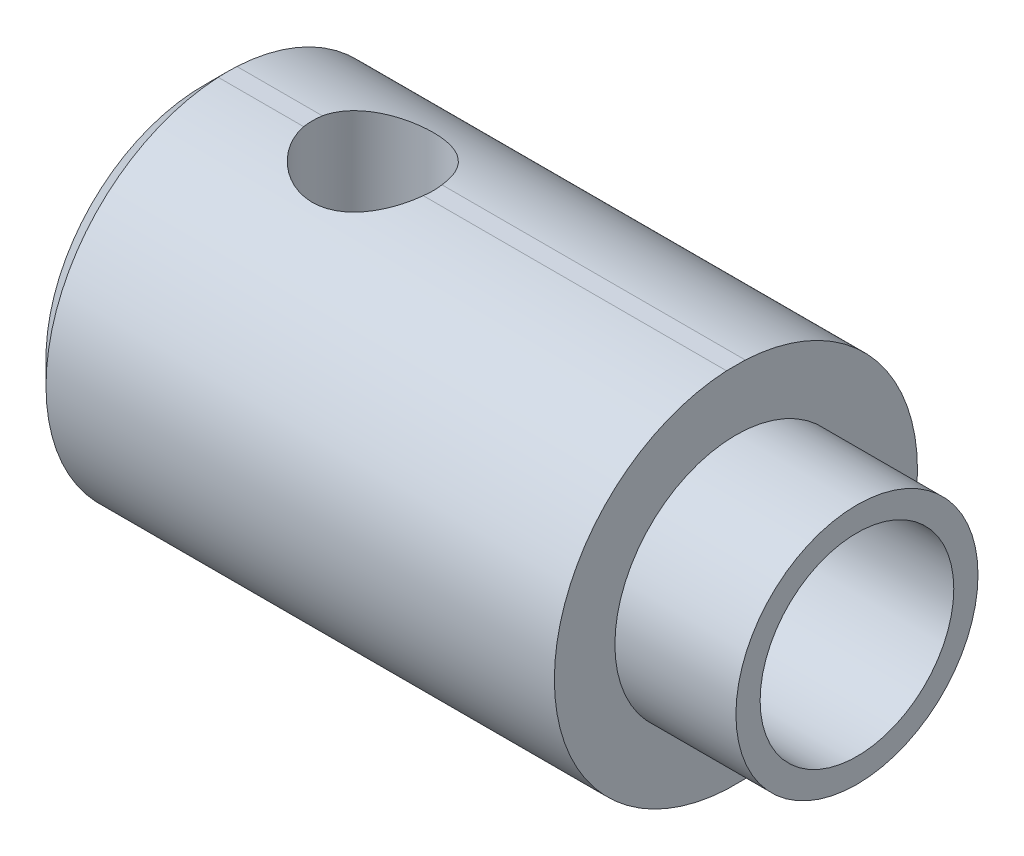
ISO-10303-21;
HEADER;
FILE_DESCRIPTION(('STEP AP214'),'2;1');
FILE_NAME('part.step','',(''),(''),'','','');
FILE_SCHEMA(('AUTOMOTIVE_DESIGN { 1 0 10303 214 1 1 1 1 }'));
ENDSEC;
DATA;
#1=APPLICATION_CONTEXT('core data for automotive mechanical design processes');
#2=APPLICATION_PROTOCOL_DEFINITION('international standard','automotive_design',2000,#1);
#3=PRODUCT_CONTEXT('',#1,'mechanical');
#4=PRODUCT('Part','Part','',(#3));
#5=PRODUCT_RELATED_PRODUCT_CATEGORY('part','',(#4));
#6=PRODUCT_DEFINITION_FORMATION('','',#4);
#7=PRODUCT_DEFINITION_CONTEXT('part definition',#1,'design');
#8=PRODUCT_DEFINITION('design','',#6,#7);
#9=PRODUCT_DEFINITION_SHAPE('','',#8);
#10=(LENGTH_UNIT() NAMED_UNIT(*) SI_UNIT(.MILLI.,.METRE.));
#11=(NAMED_UNIT(*) PLANE_ANGLE_UNIT() SI_UNIT($,.RADIAN.));
#12=(NAMED_UNIT(*) SI_UNIT($,.STERADIAN.) SOLID_ANGLE_UNIT());
#13=UNCERTAINTY_MEASURE_WITH_UNIT(LENGTH_MEASURE(1.E-05),#10,'distance_accuracy_value','');
#14=(GEOMETRIC_REPRESENTATION_CONTEXT(3) GLOBAL_UNCERTAINTY_ASSIGNED_CONTEXT((#13)) GLOBAL_UNIT_ASSIGNED_CONTEXT((#10,
#11,#12)) REPRESENTATION_CONTEXT('',''));
#15=CARTESIAN_POINT('',(0.,0.,0.));
#16=DIRECTION('',(0.,0.,1.));
#17=DIRECTION('',(1.,0.,0.));
#18=AXIS2_PLACEMENT_3D('',#15,#16,#17);
#19=CARTESIAN_POINT('',(-2.30940107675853,0.,0.));
#20=DIRECTION('',(1.,0.,0.));
#21=DIRECTION('',(0.,0.,-1.));
#22=AXIS2_PLACEMENT_3D('',#19,#20,#21);
#23=CYLINDRICAL_SURFACE('',#22,7.5);
#24=DIRECTION('',(1.,0.,0.));
#25=VECTOR('',#24,1.);
#26=CARTESIAN_POINT('',(-7.,7.49,-0.387169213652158));
#27=LINE('',#26,#25);
#28=CARTESIAN_POINT('',(2.46983805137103,7.49000000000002,-0.387169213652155));
#29=VERTEX_POINT('',#28);
#30=CARTESIAN_POINT('',(15.,7.49,-0.387169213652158));
#31=VERTEX_POINT('',#30);
#32=EDGE_CURVE('E54',#29,#31,#27,.T.);
#33=ORIENTED_EDGE('',*,*,#32,.T.);
#34=CARTESIAN_POINT('',(15.,0.,0.));
#35=DIRECTION('',(1.,0.,0.));
#36=DIRECTION('',(0.,0.,-1.));
#37=AXIS2_PLACEMENT_3D('',#34,#35,#36);
#38=CIRCLE('',#37,7.5);
#39=CARTESIAN_POINT('',(15.,-7.49,-0.387169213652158));
#40=VERTEX_POINT('',#39);
#41=EDGE_CURVE('E123',#40,#31,#38,.T.);
#42=ORIENTED_EDGE('',*,*,#41,.F.);
#43=DIRECTION('',(1.,0.,0.));
#44=VECTOR('',#43,1.);
#45=CARTESIAN_POINT('',(-7.,-7.49,-0.387169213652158));
#46=LINE('',#45,#44);
#47=CARTESIAN_POINT('',(2.46983805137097,-7.49,-0.387169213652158));
#48=VERTEX_POINT('',#47);
#49=EDGE_CURVE('E281',#48,#40,#46,.T.);
#50=ORIENTED_EDGE('',*,*,#49,.F.);
#51=CARTESIAN_POINT('',(0.,-7.07106781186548,2.5));
#52=CARTESIAN_POINT('',(-0.13617043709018,-7.07106736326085,2.50000064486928));
#53=CARTESIAN_POINT('',(-0.272336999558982,-7.07504423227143,2.48883695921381));
#54=CARTESIAN_POINT('',(-0.540636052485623,-7.09043935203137,2.44462782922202));
#55=CARTESIAN_POINT('',(-0.672767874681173,-7.10185882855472,2.41157878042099));
#56=CARTESIAN_POINT('',(-0.92906723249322,-7.13070509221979,2.32488871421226));
#57=CARTESIAN_POINT('',(-1.05324982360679,-7.14812009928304,2.27128805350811));
#58=CARTESIAN_POINT('',(-1.2909001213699,-7.18697805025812,2.14515407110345));
#59=CARTESIAN_POINT('',(-1.40436545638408,-7.20842188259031,2.07261657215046));
#60=CARTESIAN_POINT('',(-1.62179990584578,-7.25386223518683,1.90762786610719));
#61=CARTESIAN_POINT('',(-1.72528857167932,-7.2779223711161,1.8145608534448));
#62=CARTESIAN_POINT('',(-1.9155170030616,-7.32534662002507,1.61246916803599));
#63=CARTESIAN_POINT('',(-2.00225407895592,-7.34871062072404,1.50344193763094));
#64=CARTESIAN_POINT('',(-2.15869724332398,-7.39284667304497,1.26901126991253));
#65=CARTESIAN_POINT('',(-2.22789992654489,-7.41353519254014,1.14325477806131));
#66=CARTESIAN_POINT('',(-2.34397896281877,-7.44923966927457,0.881078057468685));
#67=CARTESIAN_POINT('',(-2.39086133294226,-7.46425715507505,0.74466071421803));
#68=CARTESIAN_POINT('',(-2.45933963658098,-7.48647688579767,0.470072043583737));
#69=CARTESIAN_POINT('',(-2.48175861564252,-7.49393286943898,0.332126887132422));
#70=CARTESIAN_POINT('',(-2.50329073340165,-7.5010902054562,0.0542446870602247));
#71=CARTESIAN_POINT('',(-2.50240987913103,-7.50079355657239,-0.0856918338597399));
#72=CARTESIAN_POINT('',(-2.47788936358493,-7.49265099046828,-0.357758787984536));
#73=CARTESIAN_POINT('',(-2.45514367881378,-7.48510161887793,-0.489980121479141));
#74=CARTESIAN_POINT('',(-2.38901754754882,-7.46367418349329,-0.748608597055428));
#75=CARTESIAN_POINT('',(-2.34563570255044,-7.44979569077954,-0.875015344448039));
#76=CARTESIAN_POINT('',(-2.23894670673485,-7.41689175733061,-1.12038118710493));
#77=CARTESIAN_POINT('',(-2.17538515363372,-7.39780106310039,-1.23922055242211));
#78=CARTESIAN_POINT('',(-2.03035073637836,-7.35645982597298,-1.46481081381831));
#79=CARTESIAN_POINT('',(-1.94887289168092,-7.33420840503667,-1.57155833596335));
#80=CARTESIAN_POINT('',(-1.76581401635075,-7.28765479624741,-1.77525216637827));
#81=CARTESIAN_POINT('',(-1.6634671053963,-7.26330537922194,-1.87150039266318));
#82=CARTESIAN_POINT('',(-1.44387818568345,-7.21618338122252,-2.04569314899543));
#83=CARTESIAN_POINT('',(-1.32663388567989,-7.19341104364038,-2.12363485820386));
#84=CARTESIAN_POINT('',(-1.0783659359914,-7.15176312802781,-2.25996863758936));
#85=CARTESIAN_POINT('',(-0.947169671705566,-7.1329477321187,-2.31806615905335));
#86=CARTESIAN_POINT('',(-0.676071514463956,-7.10204127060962,-2.41110798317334));
#87=CARTESIAN_POINT('',(-0.536173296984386,-7.08994738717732,-2.44606198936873));
#88=CARTESIAN_POINT('',(-0.258404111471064,-7.07449090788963,-2.4904032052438));
#89=CARTESIAN_POINT('',(-0.12072643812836,-7.0707590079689,-2.50087273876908));
#90=CARTESIAN_POINT('',(0.154440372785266,-7.07141680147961,-2.4990135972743));
#91=CARTESIAN_POINT('',(0.29192954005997,-7.07580501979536,-2.48668906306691));
#92=CARTESIAN_POINT('',(0.557892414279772,-7.09184045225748,-2.44056412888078));
#93=CARTESIAN_POINT('',(0.686513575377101,-7.10323313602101,-2.40751598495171));
#94=CARTESIAN_POINT('',(0.936359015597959,-7.13171384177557,-2.32178465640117));
#95=CARTESIAN_POINT('',(1.05758197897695,-7.14880287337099,-2.26909799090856));
#96=CARTESIAN_POINT('',(1.29345105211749,-7.18742193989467,-2.14368585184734));
#97=CARTESIAN_POINT('',(1.4077666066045,-7.20907564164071,-2.07037779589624));
#98=CARTESIAN_POINT('',(1.6228651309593,-7.25414421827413,-1.9064640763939));
#99=CARTESIAN_POINT('',(1.72364409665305,-7.27755961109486,-1.81585331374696));
#100=CARTESIAN_POINT('',(1.9138199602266,-7.32487596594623,-1.61472926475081));
#101=CARTESIAN_POINT('',(2.00243597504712,-7.34874608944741,-1.50346817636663));
#102=CARTESIAN_POINT('',(2.15979035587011,-7.39317129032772,-1.26706822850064));
#103=CARTESIAN_POINT('',(2.22852942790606,-7.41372648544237,-1.14192986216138));
#104=CARTESIAN_POINT('',(2.34355026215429,-7.44911014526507,-0.881949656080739));
#105=CARTESIAN_POINT('',(2.38997819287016,-7.46397575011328,-0.747177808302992));
#106=CARTESIAN_POINT('',(2.45931935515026,-7.48646527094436,-0.471146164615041));
#107=CARTESIAN_POINT('',(2.48224107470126,-7.49409180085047,-0.329888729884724));
#108=CARTESIAN_POINT('',(2.50315519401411,-7.50104658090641,-0.0520383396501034));
#109=CARTESIAN_POINT('',(2.50226863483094,-7.50074800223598,0.084461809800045));
#110=CARTESIAN_POINT('',(2.47835672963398,-7.49280491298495,0.355277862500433));
#111=CARTESIAN_POINT('',(2.45533317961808,-7.48516099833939,0.489593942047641));
#112=CARTESIAN_POINT('',(2.38854441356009,-7.46352287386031,0.750105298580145));
#113=CARTESIAN_POINT('',(2.34511446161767,-7.44963145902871,0.876395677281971));
#114=CARTESIAN_POINT('',(2.23905617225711,-7.41692901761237,1.11994587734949));
#115=CARTESIAN_POINT('',(2.17642436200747,-7.39811710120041,1.23720406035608));
#116=CARTESIAN_POINT('',(2.03107621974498,-7.35664672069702,1.46408504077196));
#117=CARTESIAN_POINT('',(1.9477032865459,-7.33387181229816,1.57326562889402));
#118=CARTESIAN_POINT('',(1.76435652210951,-7.28732471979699,1.77645256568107));
#119=CARTESIAN_POINT('',(1.66437739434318,-7.26355221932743,1.87045405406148));
#120=CARTESIAN_POINT('',(1.44597661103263,-7.21658199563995,2.04435452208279));
#121=CARTESIAN_POINT('',(1.3269862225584,-7.19344319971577,2.12355741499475));
#122=CARTESIAN_POINT('',(1.07666393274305,-7.15150483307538,2.26078585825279));
#123=CARTESIAN_POINT('',(0.945335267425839,-7.13270412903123,2.31881694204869));
#124=CARTESIAN_POINT('',(0.680095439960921,-7.10253335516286,2.40960957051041));
#125=CARTESIAN_POINT('',(0.546569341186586,-7.09086582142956,2.4433947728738));
#126=CARTESIAN_POINT('',(0.275359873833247,-7.07513458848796,2.48858580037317));
#127=CARTESIAN_POINT('',(0.137677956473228,-7.07106826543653,2.49999934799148));
#128=CARTESIAN_POINT('',(0.,-7.07106781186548,2.5));
#129=B_SPLINE_CURVE_WITH_KNOTS('',3,(#51,#52,#53,#54,#55,#56,#57,#58,#59,#60,#61,#62,#63,#64,
#65,#66,#67,#68,#69,#70,#71,#72,#73,#74,#75,#76,#77,#78,#79,#80,#81,#82,#83,#84,#85,#86,#87,#88,
#89,#90,#91,#92,#93,#94,#95,#96,#97,#98,#99,#100,#101,#102,#103,#104,#105,#106,#107,#108,#109,
#110,#111,#112,#113,#114,#115,#116,#117,#118,#119,#120,#121,#122,#123,#124,#125,#126,#127,#128),
.UNSPECIFIED.,.T.,.F.,(4,2,2,2,2,2,2,2,2,2,2,2,2,2,2,2,2,2,2,2,2,2,2,2,2,2,2,2,2,2,2,2,2,2,2,2,
2,2,4),(0.,0.40800146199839,0.816070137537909,1.22334156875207,1.63070291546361,2.0525334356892,
2.4744316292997,2.90733765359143,3.34012690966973,3.75785796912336,4.17548133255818,
4.57672512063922,4.97799610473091,5.38454137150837,5.79119979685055,6.21700435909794,
6.64287449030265,7.07481599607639,7.50657628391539,7.91885728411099,8.33106339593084,
8.7291098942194,9.12722697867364,9.53797144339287,9.94883714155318,10.3794702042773,
10.8100879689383,11.2378447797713,11.6654470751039,12.0729521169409,12.4804241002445,
12.8814239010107,13.2824962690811,13.6983879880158,14.1144126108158,14.5467225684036,
14.9789194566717,15.3915803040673,15.8040986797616),.UNSPECIFIED.);
#130=CARTESIAN_POINT('',(-2.46983805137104,-7.49000000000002,-0.38716921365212));
#131=VERTEX_POINT('',#130);
#132=EDGE_CURVE('E253',#131,#48,#129,.T.);
#133=ORIENTED_EDGE('',*,*,#132,.F.);
#134=CARTESIAN_POINT('',(-6.,-7.49,-0.387169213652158));
#135=VERTEX_POINT('',#134);
#136=EDGE_CURVE('E282',#135,#131,#46,.T.);
#137=ORIENTED_EDGE('',*,*,#136,.F.);
#138=CARTESIAN_POINT('',(-6.,0.,0.));
#139=DIRECTION('',(1.,0.,0.));
#140=DIRECTION('',(0.,0.,-1.));
#141=AXIS2_PLACEMENT_3D('',#138,#139,#140);
#142=CIRCLE('',#141,7.5);
#143=CARTESIAN_POINT('',(-6.,7.49,-0.387169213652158));
#144=VERTEX_POINT('',#143);
#145=EDGE_CURVE('E129',#135,#144,#142,.T.);
#146=ORIENTED_EDGE('',*,*,#145,.T.);
#147=CARTESIAN_POINT('',(-2.46983805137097,7.49,-0.387169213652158));
#148=VERTEX_POINT('',#147);
#149=EDGE_CURVE('E215',#144,#148,#27,.T.);
#150=ORIENTED_EDGE('',*,*,#149,.T.);
#151=CARTESIAN_POINT('',(0.,7.07106781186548,2.5));
#152=CARTESIAN_POINT('',(0.13617043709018,7.07106736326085,2.50000064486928));
#153=CARTESIAN_POINT('',(0.272336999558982,7.07504423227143,2.48883695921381));
#154=CARTESIAN_POINT('',(0.540636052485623,7.09043935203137,2.44462782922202));
#155=CARTESIAN_POINT('',(0.672767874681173,7.10185882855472,2.41157878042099));
#156=CARTESIAN_POINT('',(0.92906723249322,7.13070509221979,2.32488871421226));
#157=CARTESIAN_POINT('',(1.05324982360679,7.14812009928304,2.27128805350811));
#158=CARTESIAN_POINT('',(1.2909001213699,7.18697805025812,2.14515407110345));
#159=CARTESIAN_POINT('',(1.40436545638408,7.20842188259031,2.07261657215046));
#160=CARTESIAN_POINT('',(1.62179990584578,7.25386223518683,1.90762786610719));
#161=CARTESIAN_POINT('',(1.72528857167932,7.2779223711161,1.8145608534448));
#162=CARTESIAN_POINT('',(1.9155170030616,7.32534662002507,1.61246916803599));
#163=CARTESIAN_POINT('',(2.00225407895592,7.34871062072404,1.50344193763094));
#164=CARTESIAN_POINT('',(2.15869724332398,7.39284667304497,1.26901126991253));
#165=CARTESIAN_POINT('',(2.22789992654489,7.41353519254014,1.14325477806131));
#166=CARTESIAN_POINT('',(2.34397896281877,7.44923966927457,0.881078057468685));
#167=CARTESIAN_POINT('',(2.39086133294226,7.46425715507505,0.74466071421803));
#168=CARTESIAN_POINT('',(2.45933963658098,7.48647688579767,0.470072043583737));
#169=CARTESIAN_POINT('',(2.48175861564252,7.49393286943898,0.332126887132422));
#170=CARTESIAN_POINT('',(2.50329073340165,7.5010902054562,0.0542446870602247));
#171=CARTESIAN_POINT('',(2.50240987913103,7.50079355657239,-0.0856918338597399));
#172=CARTESIAN_POINT('',(2.47788936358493,7.49265099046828,-0.357758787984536));
#173=CARTESIAN_POINT('',(2.45514367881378,7.48510161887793,-0.489980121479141));
#174=CARTESIAN_POINT('',(2.38901754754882,7.46367418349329,-0.748608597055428));
#175=CARTESIAN_POINT('',(2.34563570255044,7.44979569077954,-0.875015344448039));
#176=CARTESIAN_POINT('',(2.23894670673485,7.41689175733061,-1.12038118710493));
#177=CARTESIAN_POINT('',(2.17538515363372,7.39780106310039,-1.23922055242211));
#178=CARTESIAN_POINT('',(2.03035073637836,7.35645982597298,-1.46481081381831));
#179=CARTESIAN_POINT('',(1.94887289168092,7.33420840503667,-1.57155833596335));
#180=CARTESIAN_POINT('',(1.76581401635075,7.28765479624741,-1.77525216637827));
#181=CARTESIAN_POINT('',(1.6634671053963,7.26330537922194,-1.87150039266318));
#182=CARTESIAN_POINT('',(1.44387818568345,7.21618338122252,-2.04569314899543));
#183=CARTESIAN_POINT('',(1.32663388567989,7.19341104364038,-2.12363485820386));
#184=CARTESIAN_POINT('',(1.0783659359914,7.15176312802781,-2.25996863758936));
#185=CARTESIAN_POINT('',(0.947169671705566,7.1329477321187,-2.31806615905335));
#186=CARTESIAN_POINT('',(0.676071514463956,7.10204127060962,-2.41110798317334));
#187=CARTESIAN_POINT('',(0.536173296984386,7.08994738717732,-2.44606198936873));
#188=CARTESIAN_POINT('',(0.258404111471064,7.07449090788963,-2.4904032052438));
#189=CARTESIAN_POINT('',(0.12072643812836,7.0707590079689,-2.50087273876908));
#190=CARTESIAN_POINT('',(-0.154440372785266,7.07141680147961,-2.4990135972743));
#191=CARTESIAN_POINT('',(-0.29192954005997,7.07580501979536,-2.48668906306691));
#192=CARTESIAN_POINT('',(-0.557892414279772,7.09184045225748,-2.44056412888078));
#193=CARTESIAN_POINT('',(-0.686513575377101,7.10323313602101,-2.40751598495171));
#194=CARTESIAN_POINT('',(-0.936359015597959,7.13171384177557,-2.32178465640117));
#195=CARTESIAN_POINT('',(-1.05758197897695,7.14880287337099,-2.26909799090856));
#196=CARTESIAN_POINT('',(-1.29345105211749,7.18742193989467,-2.14368585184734));
#197=CARTESIAN_POINT('',(-1.4077666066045,7.20907564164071,-2.07037779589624));
#198=CARTESIAN_POINT('',(-1.6228651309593,7.25414421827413,-1.9064640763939));
#199=CARTESIAN_POINT('',(-1.72364409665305,7.27755961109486,-1.81585331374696));
#200=CARTESIAN_POINT('',(-1.9138199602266,7.32487596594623,-1.61472926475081));
#201=CARTESIAN_POINT('',(-2.00243597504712,7.34874608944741,-1.50346817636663));
#202=CARTESIAN_POINT('',(-2.15979035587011,7.39317129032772,-1.26706822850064));
#203=CARTESIAN_POINT('',(-2.22852942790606,7.41372648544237,-1.14192986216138));
#204=CARTESIAN_POINT('',(-2.34355026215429,7.44911014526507,-0.881949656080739));
#205=CARTESIAN_POINT('',(-2.38997819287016,7.46397575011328,-0.747177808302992));
#206=CARTESIAN_POINT('',(-2.45931935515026,7.48646527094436,-0.471146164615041));
#207=CARTESIAN_POINT('',(-2.48224107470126,7.49409180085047,-0.329888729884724));
#208=CARTESIAN_POINT('',(-2.50315519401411,7.50104658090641,-0.0520383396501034));
#209=CARTESIAN_POINT('',(-2.50226863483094,7.50074800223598,0.084461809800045));
#210=CARTESIAN_POINT('',(-2.47835672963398,7.49280491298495,0.355277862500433));
#211=CARTESIAN_POINT('',(-2.45533317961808,7.48516099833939,0.489593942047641));
#212=CARTESIAN_POINT('',(-2.38854441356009,7.46352287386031,0.750105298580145));
#213=CARTESIAN_POINT('',(-2.34511446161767,7.44963145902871,0.876395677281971));
#214=CARTESIAN_POINT('',(-2.23905617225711,7.41692901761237,1.11994587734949));
#215=CARTESIAN_POINT('',(-2.17642436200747,7.39811710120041,1.23720406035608));
#216=CARTESIAN_POINT('',(-2.03107621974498,7.35664672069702,1.46408504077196));
#217=CARTESIAN_POINT('',(-1.9477032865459,7.33387181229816,1.57326562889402));
#218=CARTESIAN_POINT('',(-1.76435652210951,7.28732471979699,1.77645256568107));
#219=CARTESIAN_POINT('',(-1.66437739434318,7.26355221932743,1.87045405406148));
#220=CARTESIAN_POINT('',(-1.44597661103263,7.21658199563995,2.04435452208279));
#221=CARTESIAN_POINT('',(-1.3269862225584,7.19344319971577,2.12355741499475));
#222=CARTESIAN_POINT('',(-1.07666393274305,7.15150483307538,2.26078585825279));
#223=CARTESIAN_POINT('',(-0.945335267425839,7.13270412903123,2.31881694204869));
#224=CARTESIAN_POINT('',(-0.680095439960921,7.10253335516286,2.40960957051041));
#225=CARTESIAN_POINT('',(-0.546569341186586,7.09086582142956,2.4433947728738));
#226=CARTESIAN_POINT('',(-0.275359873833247,7.07513458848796,2.48858580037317));
#227=CARTESIAN_POINT('',(-0.137677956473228,7.07106826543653,2.49999934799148));
#228=CARTESIAN_POINT('',(0.,7.07106781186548,2.5));
#229=B_SPLINE_CURVE_WITH_KNOTS('',3,(#151,#152,#153,#154,#155,#156,#157,#158,#159,#160,#161,
#162,#163,#164,#165,#166,#167,#168,#169,#170,#171,#172,#173,#174,#175,#176,#177,#178,#179,#180,
#181,#182,#183,#184,#185,#186,#187,#188,#189,#190,#191,#192,#193,#194,#195,#196,#197,#198,#199,
#200,#201,#202,#203,#204,#205,#206,#207,#208,#209,#210,#211,#212,#213,#214,#215,#216,#217,#218,
#219,#220,#221,#222,#223,#224,#225,#226,#227,#228),.UNSPECIFIED.,.T.,.F.,(4,2,2,2,2,2,2,2,2,2,2,
2,2,2,2,2,2,2,2,2,2,2,2,2,2,2,2,2,2,2,2,2,2,2,2,2,2,2,4),(0.,0.40800146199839,0.816070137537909,
1.22334156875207,1.63070291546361,2.0525334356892,2.4744316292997,2.90733765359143,
3.34012690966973,3.75785796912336,4.17548133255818,4.57672512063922,4.97799610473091,
5.38454137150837,5.79119979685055,6.21700435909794,6.64287449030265,7.07481599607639,
7.50657628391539,7.91885728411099,8.33106339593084,8.7291098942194,9.12722697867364,
9.53797144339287,9.94883714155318,10.3794702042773,10.8100879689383,11.2378447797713,
11.6654470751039,12.0729521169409,12.4804241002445,12.8814239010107,13.2824962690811,
13.6983879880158,14.1144126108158,14.5467225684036,14.9789194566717,15.3915803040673,
15.8040986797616),.UNSPECIFIED.);
#230=EDGE_CURVE('E186',#29,#148,#229,.T.);
#231=ORIENTED_EDGE('',*,*,#230,.F.);
#232=EDGE_LOOP('',(#33,#42,#50,#133,#137,#146,#150,#231));
#233=FACE_BOUND('',#232,.T.);
#234=ADVANCED_FACE('F32',(#233),#23,.T.);
#235=CARTESIAN_POINT('',(-2.30940107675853,0.,0.));
#236=DIRECTION('',(1.,0.,0.));
#237=DIRECTION('',(0.,0.,-1.));
#238=AXIS2_PLACEMENT_3D('',#235,#236,#237);
#239=CONICAL_SURFACE('',#238,0.,1.04719755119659);
#240=CARTESIAN_POINT('',(0.231140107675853,3.62856366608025,2.48929191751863));
#241=CARTESIAN_POINT('',(0.191756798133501,3.54332545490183,2.49294936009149));
#242=CARTESIAN_POINT('',(0.152520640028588,3.45798134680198,2.49564923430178));
#243=CARTESIAN_POINT('',(0.0744416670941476,3.28707695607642,2.49919692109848));
#244=CARTESIAN_POINT('',(0.035598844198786,3.2015166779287,2.50004477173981));
#245=CARTESIAN_POINT('',(-0.0802184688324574,2.94444431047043,2.49990503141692));
#246=CARTESIAN_POINT('',(-0.156456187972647,2.77259584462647,2.49623186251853));
#247=CARTESIAN_POINT('',(-0.309923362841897,2.4182986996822,2.48197104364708));
#248=CARTESIAN_POINT('',(-0.386975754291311,2.23578796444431,2.47101333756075));
#249=CARTESIAN_POINT('',(-0.498055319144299,1.96057521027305,2.45017752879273));
#250=CARTESIAN_POINT('',(-0.534328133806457,1.86860705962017,2.44250017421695));
#251=CARTESIAN_POINT('',(-0.604853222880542,1.68399998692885,2.42599711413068));
#252=CARTESIAN_POINT('',(-0.639105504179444,1.59136106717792,2.41717141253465));
#253=CARTESIAN_POINT('',(-0.710600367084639,1.38904433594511,2.39721605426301));
#254=CARTESIAN_POINT('',(-0.747332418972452,1.27919599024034,2.38595218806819));
#255=CARTESIAN_POINT('',(-0.798349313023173,1.11314167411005,2.36916927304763));
#256=CARTESIAN_POINT('',(-0.814676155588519,1.0575710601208,2.36359323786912));
#257=CARTESIAN_POINT('',(-0.845683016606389,0.945912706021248,2.35267726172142));
#258=CARTESIAN_POINT('',(-0.86036198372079,0.889824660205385,2.34733747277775));
#259=CARTESIAN_POINT('',(-0.900747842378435,0.723533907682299,2.33226510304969));
#260=CARTESIAN_POINT('',(-0.923677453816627,0.612560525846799,2.32318059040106));
#261=CARTESIAN_POINT('',(-0.959078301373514,0.38874817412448,2.30879854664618));
#262=CARTESIAN_POINT('',(-0.971561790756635,0.275911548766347,2.30349657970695));
#263=CARTESIAN_POINT('',(-0.983873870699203,0.0470347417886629,2.29827177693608));
#264=CARTESIAN_POINT('',(-0.983437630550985,-0.0690236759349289,2.29846150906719));
#265=CARTESIAN_POINT('',(-0.969344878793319,-0.300221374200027,2.30443328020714));
#266=CARTESIAN_POINT('',(-0.955676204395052,-0.415359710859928,2.31022046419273));
#267=CARTESIAN_POINT('',(-0.917256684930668,-0.646376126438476,2.32573917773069));
#268=CARTESIAN_POINT('',(-0.892235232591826,-0.762199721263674,2.33556643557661));
#269=CARTESIAN_POINT('',(-0.834331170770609,-0.991685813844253,2.35687093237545));
#270=CARTESIAN_POINT('',(-0.801444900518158,-1.10534727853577,2.36834893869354));
#271=CARTESIAN_POINT('',(-0.732193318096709,-1.3250392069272,2.39063804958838));
#272=CARTESIAN_POINT('',(-0.696101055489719,-1.4311571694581,2.4014525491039));
#273=CARTESIAN_POINT('',(-0.620553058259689,-1.64229741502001,2.42207540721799));
#274=CARTESIAN_POINT('',(-0.581096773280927,-1.74731951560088,2.43188360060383));
#275=CARTESIAN_POINT('',(-0.49978799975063,-1.95658248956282,2.44988740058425));
#276=CARTESIAN_POINT('',(-0.457935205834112,-2.06082326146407,2.45808280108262));
#277=CARTESIAN_POINT('',(-0.37248946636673,-2.26872832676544,2.47247445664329));
#278=CARTESIAN_POINT('',(-0.32889650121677,-2.37239261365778,2.47867068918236));
#279=CARTESIAN_POINT('',(-0.243295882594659,-2.57256126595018,2.48848182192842));
#280=CARTESIAN_POINT('',(-0.201369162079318,-2.66909335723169,2.49223824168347));
#281=CARTESIAN_POINT('',(-0.116654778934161,-2.86183955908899,2.49763758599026));
#282=CARTESIAN_POINT('',(-0.0738671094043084,-2.95805366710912,2.49928049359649));
#283=CARTESIAN_POINT('',(0.0123401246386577,-3.15014217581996,2.50034093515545));
#284=CARTESIAN_POINT('',(0.0557592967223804,-3.24601674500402,2.49975979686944));
#285=CARTESIAN_POINT('',(0.143105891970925,-3.43749305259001,2.4962839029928));
#286=CARTESIAN_POINT('',(0.187033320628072,-3.5330947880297,2.49338912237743));
#287=CARTESIAN_POINT('',(0.231140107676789,-3.62856366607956,2.48929191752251));
#288=B_SPLINE_CURVE_WITH_KNOTS('',3,(#240,#241,#242,#243,#244,#245,#246,#247,#248,#249,#250,
#251,#252,#253,#254,#255,#256,#257,#258,#259,#260,#261,#262,#263,#264,#265,#266,#267,#268,#269,
#270,#271,#272,#273,#274,#275,#276,#277,#278,#279,#280,#281,#282,#283,#284,#285,#286,#287),
.UNSPECIFIED.,.F.,.F.,(4,2,2,2,2,2,2,2,2,2,2,2,2,2,2,2,2,2,2,2,2,2,2,4),(0.,0.281893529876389,
0.563781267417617,1.12773917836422,1.72279022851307,2.02024809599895,2.31770494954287,
2.66671287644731,2.84125126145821,3.01590037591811,3.35652869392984,3.6967568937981,
4.0439638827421,4.39149031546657,4.74777497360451,5.10422579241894,5.44197543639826,
5.7797804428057,6.11762858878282,6.45548054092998,6.77138884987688,7.08729969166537,
7.40302196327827,7.71874764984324),.UNSPECIFIED.);
#289=CARTESIAN_POINT('',(0.,3.1224989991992,2.5));
#290=VERTEX_POINT('',#289);
#291=CARTESIAN_POINT('',(0.,-3.1224989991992,2.5));
#292=VERTEX_POINT('',#291);
#293=EDGE_CURVE('E177',#290,#292,#288,.T.);
#294=ORIENTED_EDGE('',*,*,#293,.F.);
#295=CARTESIAN_POINT('',(0.,0.,0.));
#296=DIRECTION('',(1.,0.,0.));
#297=DIRECTION('',(0.,0.,-1.));
#298=AXIS2_PLACEMENT_3D('',#295,#296,#297);
#299=CIRCLE('',#298,4.);
#300=EDGE_CURVE('E242',#290,#292,#299,.T.);
#301=ORIENTED_EDGE('',*,*,#300,.T.);
#302=EDGE_LOOP('',(#294,#301));
#303=FACE_BOUND('',#302,.T.);
#304=ADVANCED_FACE('F202',(#303),#239,.F.);
#305=CARTESIAN_POINT('',(-2.30940107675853,0.,0.));
#306=DIRECTION('',(1.,0.,0.));
#307=DIRECTION('',(0.,0.,-1.));
#308=AXIS2_PLACEMENT_3D('',#305,#306,#307);
#309=CYLINDRICAL_SURFACE('',#308,5.);
#310=CARTESIAN_POINT('',(15.,0.,0.));
#311=DIRECTION('',(1.,0.,0.));
#312=DIRECTION('',(0.,0.,-1.));
#313=AXIS2_PLACEMENT_3D('',#310,#311,#312);
#314=CIRCLE('',#313,5.);
#315=CARTESIAN_POINT('',(15.,0.,-5.));
#316=VERTEX_POINT('',#315);
#317=EDGE_CURVE('E131',#316,#316,#314,.T.);
#318=ORIENTED_EDGE('',*,*,#317,.T.);
#319=EDGE_LOOP('',(#318));
#320=FACE_BOUND('',#319,.T.);
#321=CARTESIAN_POINT('',(20.,0.,0.));
#322=DIRECTION('',(1.,0.,0.));
#323=DIRECTION('',(0.,0.,-1.));
#324=AXIS2_PLACEMENT_3D('',#321,#322,#323);
#325=CIRCLE('',#324,5.00000000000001);
#326=CARTESIAN_POINT('',(20.,0.,-5.00000000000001));
#327=VERTEX_POINT('',#326);
#328=EDGE_CURVE('E251',#327,#327,#325,.T.);
#329=ORIENTED_EDGE('',*,*,#328,.F.);
#330=EDGE_LOOP('',(#329));
#331=FACE_BOUND('',#330,.T.);
#332=ADVANCED_FACE('F34',(#320,#331),#309,.T.);
#333=CARTESIAN_POINT('',(15.,0.,-5.));
#334=DIRECTION('',(1.,0.,0.));
#335=DIRECTION('',(0.,0.,-1.));
#336=AXIS2_PLACEMENT_3D('',#333,#334,#335);
#337=PLANE('',#336);
#338=DIRECTION('',(0.,0.,-1.));
#339=VECTOR('',#338,1.);
#340=CARTESIAN_POINT('',(15.,7.49,-0.387169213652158));
#341=LINE('',#340,#339);
#342=CARTESIAN_POINT('',(15.,7.49,0.387169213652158));
#343=VERTEX_POINT('',#342);
#344=EDGE_CURVE('E109',#343,#31,#341,.T.);
#345=ORIENTED_EDGE('',*,*,#344,.F.);
#346=CARTESIAN_POINT('',(15.,-7.49,0.387169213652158));
#347=VERTEX_POINT('',#346);
#348=EDGE_CURVE('E120',#343,#347,#38,.T.);
#349=ORIENTED_EDGE('',*,*,#348,.T.);
#350=DIRECTION('',(0.,0.,1.));
#351=VECTOR('',#350,1.);
#352=CARTESIAN_POINT('',(15.,-7.49,-0.387169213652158));
#353=LINE('',#352,#351);
#354=EDGE_CURVE('E223',#40,#347,#353,.T.);
#355=ORIENTED_EDGE('',*,*,#354,.F.);
#356=ORIENTED_EDGE('',*,*,#41,.T.);
#357=EDGE_LOOP('',(#345,#349,#355,#356));
#358=FACE_BOUND('',#357,.T.);
#359=ORIENTED_EDGE('',*,*,#317,.F.);
#360=EDGE_LOOP('',(#359));
#361=FACE_BOUND('',#360,.T.);
#362=ADVANCED_FACE('F117',(#358,#361),#337,.T.);
#363=DIRECTION('',(1.,0.,0.));
#364=VECTOR('',#363,1.);
#365=CARTESIAN_POINT('',(-7.,7.49,0.387169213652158));
#366=LINE('',#365,#364);
#367=CARTESIAN_POINT('',(-6.,7.49,0.387169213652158));
#368=VERTEX_POINT('',#367);
#369=CARTESIAN_POINT('',(-2.46983805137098,7.49,0.387169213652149));
#370=VERTEX_POINT('',#369);
#371=EDGE_CURVE('E47',#368,#370,#366,.T.);
#372=ORIENTED_EDGE('',*,*,#371,.F.);
#373=CARTESIAN_POINT('',(-6.,-7.49,0.387169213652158));
#374=VERTEX_POINT('',#373);
#375=EDGE_CURVE('E133',#368,#374,#142,.T.);
#376=ORIENTED_EDGE('',*,*,#375,.T.);
#377=DIRECTION('',(1.,0.,0.));
#378=VECTOR('',#377,1.);
#379=CARTESIAN_POINT('',(-7.,-7.49,0.387169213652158));
#380=LINE('',#379,#378);
#381=CARTESIAN_POINT('',(-2.46983805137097,-7.49,0.387169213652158));
#382=VERTEX_POINT('',#381);
#383=EDGE_CURVE('E274',#374,#382,#380,.T.);
#384=ORIENTED_EDGE('',*,*,#383,.T.);
#385=CARTESIAN_POINT('',(2.46983805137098,-7.49,0.387169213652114));
#386=VERTEX_POINT('',#385);
#387=EDGE_CURVE('E187',#386,#382,#129,.T.);
#388=ORIENTED_EDGE('',*,*,#387,.F.);
#389=EDGE_CURVE('E128',#386,#347,#380,.T.);
#390=ORIENTED_EDGE('',*,*,#389,.T.);
#391=ORIENTED_EDGE('',*,*,#348,.F.);
#392=CARTESIAN_POINT('',(2.46983805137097,7.49,0.387169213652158));
#393=VERTEX_POINT('',#392);
#394=EDGE_CURVE('E106',#393,#343,#366,.T.);
#395=ORIENTED_EDGE('',*,*,#394,.F.);
#396=EDGE_CURVE('E182',#370,#393,#229,.T.);
#397=ORIENTED_EDGE('',*,*,#396,.F.);
#398=EDGE_LOOP('',(#372,#376,#384,#388,#390,#391,#395,#397));
#399=FACE_BOUND('',#398,.T.);
#400=ADVANCED_FACE('F126',(#399),#23,.T.);
#401=CARTESIAN_POINT('',(-6.,0.,0.));
#402=DIRECTION('',(1.,0.,0.));
#403=DIRECTION('',(0.,0.,-1.));
#404=AXIS2_PLACEMENT_3D('',#401,#402,#403);
#405=CONICAL_SURFACE('',#404,7.5,0.785398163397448);
#406=CARTESIAN_POINT('',(-5.58075238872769,7.49,-2.57184422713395));
#407=CARTESIAN_POINT('',(-5.64395061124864,7.49,-2.37737671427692));
#408=CARTESIAN_POINT('',(-5.70131241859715,7.49,-2.18089857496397));
#409=CARTESIAN_POINT('',(-5.80277665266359,7.49,-1.78430699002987));
#410=CARTESIAN_POINT('',(-5.8468626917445,7.49,-1.58418937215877));
#411=CARTESIAN_POINT('',(-5.91917068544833,7.49,-1.1858935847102));
#412=CARTESIAN_POINT('',(-5.94773920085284,7.49,-0.987779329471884));
#413=CARTESIAN_POINT('',(-5.98939656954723,7.49,-0.590028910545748));
#414=CARTESIAN_POINT('',(-6.0024943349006,7.49,-0.390393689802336));
#415=CARTESIAN_POINT('',(-6.01266403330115,7.49,0.00950162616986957));
#416=CARTESIAN_POINT('',(-6.00971916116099,7.49,0.209762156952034));
#417=CARTESIAN_POINT('',(-5.98789461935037,7.49,0.609501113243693));
#418=CARTESIAN_POINT('',(-5.96900662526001,7.49,0.808979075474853));
#419=CARTESIAN_POINT('',(-5.91546319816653,7.49,1.21064332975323));
#420=CARTESIAN_POINT('',(-5.88044268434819,7.49,1.41278085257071));
#421=CARTESIAN_POINT('',(-5.81711192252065,7.49,1.71356074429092));
#422=CARTESIAN_POINT('',(-5.79421180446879,7.49,1.81338098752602));
#423=CARTESIAN_POINT('',(-5.74502439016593,7.49,2.01216700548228));
#424=CARTESIAN_POINT('',(-5.71873765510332,7.49,2.1111329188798));
#425=CARTESIAN_POINT('',(-5.69086011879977,7.49,2.20965284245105));
#426=B_SPLINE_CURVE_WITH_KNOTS('',3,(#406,#407,#408,#409,#410,#411,#412,#413,#414,#415,#416,
#417,#418,#419,#420,#421,#422,#423,#424,#425),.UNSPECIFIED.,.F.,.F.,(4,2,2,2,2,2,2,2,2,4),(0.,
0.613508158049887,1.2277705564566,1.82768231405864,2.42724831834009,3.02744250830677,
3.62795027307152,4.24277091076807,4.54996123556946,4.85710072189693),.UNSPECIFIED.);
#427=EDGE_CURVE('E217',#144,#368,#426,.T.);
#428=ORIENTED_EDGE('',*,*,#427,.F.);
#429=ORIENTED_EDGE('',*,*,#145,.F.);
#430=CARTESIAN_POINT('',(-5.69086011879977,-7.49,2.20965284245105));
#431=CARTESIAN_POINT('',(-5.71873765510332,-7.49,2.1111329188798));
#432=CARTESIAN_POINT('',(-5.74502439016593,-7.49,2.01216700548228));
#433=CARTESIAN_POINT('',(-5.79421180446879,-7.49,1.81338098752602));
#434=CARTESIAN_POINT('',(-5.81711192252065,-7.49,1.71356074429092));
#435=CARTESIAN_POINT('',(-5.88044268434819,-7.49,1.41278085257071));
#436=CARTESIAN_POINT('',(-5.91546319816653,-7.49,1.21064332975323));
#437=CARTESIAN_POINT('',(-5.96900662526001,-7.49,0.808979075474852));
#438=CARTESIAN_POINT('',(-5.98789461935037,-7.49,0.609501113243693));
#439=CARTESIAN_POINT('',(-6.00971916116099,-7.49,0.209762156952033));
#440=CARTESIAN_POINT('',(-6.01266403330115,-7.49,0.00950162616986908));
#441=CARTESIAN_POINT('',(-6.0024943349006,-7.49,-0.390393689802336));
#442=CARTESIAN_POINT('',(-5.98939656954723,-7.49,-0.590028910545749));
#443=CARTESIAN_POINT('',(-5.94773920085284,-7.49,-0.987779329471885));
#444=CARTESIAN_POINT('',(-5.91917068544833,-7.49,-1.1858935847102));
#445=CARTESIAN_POINT('',(-5.8468626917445,-7.49,-1.58418937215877));
#446=CARTESIAN_POINT('',(-5.80277665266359,-7.49,-1.78430699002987));
#447=CARTESIAN_POINT('',(-5.70131241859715,-7.49,-2.18089857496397));
#448=CARTESIAN_POINT('',(-5.64395061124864,-7.49,-2.37737671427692));
#449=CARTESIAN_POINT('',(-5.58075238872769,-7.49,-2.57184422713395));
#450=B_SPLINE_CURVE_WITH_KNOTS('',3,(#430,#431,#432,#433,#434,#435,#436,#437,#438,#439,#440,
#441,#442,#443,#444,#445,#446,#447,#448,#449),.UNSPECIFIED.,.F.,.F.,(4,2,2,2,2,2,2,2,2,4),(0.,
0.307139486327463,0.614329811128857,1.2291504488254,1.82965821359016,2.42985240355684,
3.02941840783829,3.62933016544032,4.24359256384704,4.85710072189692),.UNSPECIFIED.);
#451=EDGE_CURVE('E239',#374,#135,#450,.T.);
#452=ORIENTED_EDGE('',*,*,#451,.F.);
#453=ORIENTED_EDGE('',*,*,#375,.F.);
#454=EDGE_LOOP('',(#428,#429,#452,#453));
#455=FACE_BOUND('',#454,.T.);
#456=CARTESIAN_POINT('',(-7.,0.,0.));
#457=DIRECTION('',(1.,0.,0.));
#458=DIRECTION('',(0.,0.,-1.));
#459=AXIS2_PLACEMENT_3D('',#456,#457,#458);
#460=CIRCLE('',#459,6.5);
#461=CARTESIAN_POINT('',(-7.,0.,-6.5));
#462=VERTEX_POINT('',#461);
#463=EDGE_CURVE('E240',#462,#462,#460,.T.);
#464=ORIENTED_EDGE('',*,*,#463,.T.);
#465=EDGE_LOOP('',(#464));
#466=FACE_BOUND('',#465,.T.);
#467=ADVANCED_FACE('F194',(#455,#466),#405,.T.);
#468=CARTESIAN_POINT('',(-7.,0.,-6.5));
#469=DIRECTION('',(-1.,0.,0.));
#470=DIRECTION('',(0.,0.,1.));
#471=AXIS2_PLACEMENT_3D('',#468,#469,#470);
#472=PLANE('',#471);
#473=ORIENTED_EDGE('',*,*,#463,.F.);
#474=EDGE_LOOP('',(#473));
#475=FACE_BOUND('',#474,.T.);
#476=ADVANCED_FACE('F338',(#475),#472,.T.);
#477=CARTESIAN_POINT('',(0.231140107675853,-3.62856366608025,-2.48929191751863));
#478=CARTESIAN_POINT('',(0.191756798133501,-3.54332545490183,-2.49294936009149));
#479=CARTESIAN_POINT('',(0.152520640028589,-3.45798134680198,-2.49564923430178));
#480=CARTESIAN_POINT('',(0.0744416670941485,-3.28707695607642,-2.49919692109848));
#481=CARTESIAN_POINT('',(0.0355988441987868,-3.2015166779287,-2.50004477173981));
#482=CARTESIAN_POINT('',(-0.0802184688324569,-2.94444431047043,-2.49990503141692));
#483=CARTESIAN_POINT('',(-0.156456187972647,-2.77259584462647,-2.49623186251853));
#484=CARTESIAN_POINT('',(-0.309923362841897,-2.4182986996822,-2.48197104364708));
#485=CARTESIAN_POINT('',(-0.38697575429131,-2.23578796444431,-2.47101333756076));
#486=CARTESIAN_POINT('',(-0.498055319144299,-1.96057521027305,-2.45017752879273));
#487=CARTESIAN_POINT('',(-0.534328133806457,-1.86860705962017,-2.44250017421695));
#488=CARTESIAN_POINT('',(-0.604853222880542,-1.68399998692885,-2.42599711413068));
#489=CARTESIAN_POINT('',(-0.639105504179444,-1.59136106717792,-2.41717141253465));
#490=CARTESIAN_POINT('',(-0.710600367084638,-1.38904433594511,-2.39721605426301));
#491=CARTESIAN_POINT('',(-0.747332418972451,-1.27919599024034,-2.38595218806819));
#492=CARTESIAN_POINT('',(-0.798349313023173,-1.11314167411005,-2.36916927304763));
#493=CARTESIAN_POINT('',(-0.814676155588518,-1.0575710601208,-2.36359323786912));
#494=CARTESIAN_POINT('',(-0.845683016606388,-0.945912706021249,-2.35267726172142));
#495=CARTESIAN_POINT('',(-0.860361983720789,-0.889824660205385,-2.34733747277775));
#496=CARTESIAN_POINT('',(-0.900747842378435,-0.7235339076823,-2.33226510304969));
#497=CARTESIAN_POINT('',(-0.923677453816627,-0.6125605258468,-2.32318059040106));
#498=CARTESIAN_POINT('',(-0.959078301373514,-0.388748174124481,-2.30879854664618));
#499=CARTESIAN_POINT('',(-0.971561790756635,-0.275911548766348,-2.30349657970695));
#500=CARTESIAN_POINT('',(-0.983873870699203,-0.047034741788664,-2.29827177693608));
#501=CARTESIAN_POINT('',(-0.983437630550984,0.0690236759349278,-2.29846150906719));
#502=CARTESIAN_POINT('',(-0.969344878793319,0.300221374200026,-2.30443328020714));
#503=CARTESIAN_POINT('',(-0.955676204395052,0.415359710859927,-2.31022046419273));
#504=CARTESIAN_POINT('',(-0.917256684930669,0.646376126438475,-2.32573917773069));
#505=CARTESIAN_POINT('',(-0.892235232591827,0.762199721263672,-2.33556643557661));
#506=CARTESIAN_POINT('',(-0.83433117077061,0.991685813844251,-2.35687093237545));
#507=CARTESIAN_POINT('',(-0.801444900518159,1.10534727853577,-2.36834893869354));
#508=CARTESIAN_POINT('',(-0.73219331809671,1.3250392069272,-2.39063804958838));
#509=CARTESIAN_POINT('',(-0.69610105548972,1.4311571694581,-2.4014525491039));
#510=CARTESIAN_POINT('',(-0.620553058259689,1.64229741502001,-2.42207540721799));
#511=CARTESIAN_POINT('',(-0.581096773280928,1.74731951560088,-2.43188360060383));
#512=CARTESIAN_POINT('',(-0.499787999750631,1.95658248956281,-2.44988740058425));
#513=CARTESIAN_POINT('',(-0.457935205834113,2.06082326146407,-2.45808280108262));
#514=CARTESIAN_POINT('',(-0.37248946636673,2.26872832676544,-2.47247445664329));
#515=CARTESIAN_POINT('',(-0.32889650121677,2.37239261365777,-2.47867068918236));
#516=CARTESIAN_POINT('',(-0.243295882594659,2.57256126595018,-2.48848182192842));
#517=CARTESIAN_POINT('',(-0.201369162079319,2.66909335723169,-2.49223824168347));
#518=CARTESIAN_POINT('',(-0.116654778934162,2.86183955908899,-2.49763758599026));
#519=CARTESIAN_POINT('',(-0.0738671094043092,2.95805366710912,-2.49928049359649));
#520=CARTESIAN_POINT('',(0.0123401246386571,3.15014217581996,-2.50034093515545));
#521=CARTESIAN_POINT('',(0.0557592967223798,3.24601674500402,-2.49975979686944));
#522=CARTESIAN_POINT('',(0.143105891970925,3.43749305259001,-2.4962839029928));
#523=CARTESIAN_POINT('',(0.187033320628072,3.5330947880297,-2.49338912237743));
#524=CARTESIAN_POINT('',(0.231140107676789,3.62856366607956,-2.48929191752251));
#525=B_SPLINE_CURVE_WITH_KNOTS('',3,(#477,#478,#479,#480,#481,#482,#483,#484,#485,#486,#487,
#488,#489,#490,#491,#492,#493,#494,#495,#496,#497,#498,#499,#500,#501,#502,#503,#504,#505,#506,
#507,#508,#509,#510,#511,#512,#513,#514,#515,#516,#517,#518,#519,#520,#521,#522,#523,#524),
.UNSPECIFIED.,.F.,.F.,(4,2,2,2,2,2,2,2,2,2,2,2,2,2,2,2,2,2,2,2,2,2,2,4),(0.,0.281893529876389,
0.563781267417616,1.12773917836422,1.72279022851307,2.02024809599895,2.31770494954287,
2.66671287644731,2.84125126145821,3.01590037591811,3.35652869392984,3.6967568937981,
4.0439638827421,4.39149031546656,4.74777497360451,5.10422579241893,5.44197543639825,
5.77978044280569,6.11762858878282,6.45548054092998,6.77138884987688,7.08729969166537,
7.40302196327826,7.71874764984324),.UNSPECIFIED.);
#526=CARTESIAN_POINT('',(0.,-3.1224989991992,-2.5));
#527=VERTEX_POINT('',#526);
#528=CARTESIAN_POINT('',(0.,3.1224989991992,-2.5));
#529=VERTEX_POINT('',#528);
#530=EDGE_CURVE('E171',#527,#529,#525,.T.);
#531=ORIENTED_EDGE('',*,*,#530,.F.);
#532=EDGE_CURVE('E245',#527,#529,#299,.T.);
#533=ORIENTED_EDGE('',*,*,#532,.T.);
#534=EDGE_LOOP('',(#531,#533));
#535=FACE_BOUND('',#534,.T.);
#536=ADVANCED_FACE('F210',(#535),#239,.F.);
#537=CARTESIAN_POINT('',(-2.30940107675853,0.,0.));
#538=DIRECTION('',(1.,0.,0.));
#539=DIRECTION('',(0.,0.,-1.));
#540=AXIS2_PLACEMENT_3D('',#537,#538,#539);
#541=CYLINDRICAL_SURFACE('',#540,4.);
#542=CARTESIAN_POINT('',(0.,3.1224989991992,-2.5));
#543=CARTESIAN_POINT('',(0.0625890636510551,3.12246983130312,-2.50001477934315));
#544=CARTESIAN_POINT('',(0.125160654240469,3.12438008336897,-2.49765019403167));
#545=CARTESIAN_POINT('',(0.249668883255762,3.13185657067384,-2.48828029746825));
#546=CARTESIAN_POINT('',(0.311606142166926,3.13741879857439,-2.48128007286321));
#547=CARTESIAN_POINT('',(0.433853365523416,3.15191422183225,-2.46283666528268));
#548=CARTESIAN_POINT('',(0.494172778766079,3.16081779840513,-2.45143249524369));
#549=CARTESIAN_POINT('',(0.613316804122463,3.18162125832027,-2.42437172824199));
#550=CARTESIAN_POINT('',(0.672141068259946,3.19352183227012,-2.40871415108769));
#551=CARTESIAN_POINT('',(0.845349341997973,3.23296077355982,-2.35582163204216));
#552=CARTESIAN_POINT('',(0.957085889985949,3.26431707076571,-2.31257077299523));
#553=CARTESIAN_POINT('',(1.1717832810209,3.33356771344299,-2.21157736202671));
#554=CARTESIAN_POINT('',(1.27472156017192,3.37147815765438,-2.15379896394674));
#555=CARTESIAN_POINT('',(1.48375197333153,3.45560279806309,-2.01646035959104));
#556=CARTESIAN_POINT('',(1.58844183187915,3.50225073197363,-1.93502498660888));
#557=CARTESIAN_POINT('',(1.78380805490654,3.59507758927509,-1.75657774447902));
#558=CARTESIAN_POINT('',(1.87447907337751,3.64125632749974,-1.65955996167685));
#559=CARTESIAN_POINT('',(2.05021634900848,3.73459351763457,-1.43834403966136));
#560=CARTESIAN_POINT('',(2.13328037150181,3.78119569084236,-1.31227798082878));
#561=CARTESIAN_POINT('',(2.24053952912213,3.84306919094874,-1.11164559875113));
#562=CARTESIAN_POINT('',(2.27341089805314,3.86236031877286,-1.04282188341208));
#563=CARTESIAN_POINT('',(2.33295285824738,3.89770328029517,-0.901763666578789));
#564=CARTESIAN_POINT('',(2.3596277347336,3.91375735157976,-0.829531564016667));
#565=CARTESIAN_POINT('',(2.4039837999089,3.94066757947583,-0.689700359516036));
#566=CARTESIAN_POINT('',(2.4223019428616,3.95188533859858,-0.622372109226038));
#567=CARTESIAN_POINT('',(2.453302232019,3.97096238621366,-0.485997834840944));
#568=CARTESIAN_POINT('',(2.46598763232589,3.97882361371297,-0.416952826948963));
#569=CARTESIAN_POINT('',(2.48551376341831,3.99095468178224,-0.277765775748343));
#570=CARTESIAN_POINT('',(2.49235809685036,3.99522673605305,-0.207624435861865));
#571=CARTESIAN_POINT('',(2.5000992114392,4.0000612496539,-0.0669115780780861));
#572=CARTESIAN_POINT('',(2.50099667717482,4.000624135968,0.00365988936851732));
#573=CARTESIAN_POINT('',(2.49527462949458,3.99704479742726,0.196045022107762));
#574=CARTESIAN_POINT('',(2.48269351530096,3.9891704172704,0.317681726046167));
#575=CARTESIAN_POINT('',(2.4402698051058,3.96290905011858,0.55663638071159));
#576=CARTESIAN_POINT('',(2.41042588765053,3.94452125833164,0.673954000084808));
#577=CARTESIAN_POINT('',(2.33479046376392,3.89876110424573,0.901775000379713));
#578=CARTESIAN_POINT('',(2.28895774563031,3.87136553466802,1.01225989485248));
#579=CARTESIAN_POINT('',(2.18305948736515,3.80971109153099,1.22404551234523));
#580=CARTESIAN_POINT('',(2.1229914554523,3.77545101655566,1.32534462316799));
#581=CARTESIAN_POINT('',(1.98195695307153,3.69787160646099,1.52940761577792));
#582=CARTESIAN_POINT('',(1.89932100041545,3.65395555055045,1.63078889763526));
#583=CARTESIAN_POINT('',(1.71976753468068,3.56392515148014,1.81916737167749));
#584=CARTESIAN_POINT('',(1.622824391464,3.5178069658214,1.9061381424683));
#585=CARTESIAN_POINT('',(1.40247981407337,3.4213791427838,2.07479570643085));
#586=CARTESIAN_POINT('',(1.27727547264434,3.37131587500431,2.15428352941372));
#587=CARTESIAN_POINT('',(1.0124055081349,3.28019806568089,2.29064190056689));
#588=CARTESIAN_POINT('',(0.872796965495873,3.23910983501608,2.3475977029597));
#589=CARTESIAN_POINT('',(0.669862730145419,3.19304444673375,2.40934510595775));
#590=CARTESIAN_POINT('',(0.611218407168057,3.18122026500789,2.42489694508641));
#591=CARTESIAN_POINT('',(0.492454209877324,3.16055340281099,2.45177269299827));
#592=CARTESIAN_POINT('',(0.432334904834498,3.15170959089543,2.46309820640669));
#593=CARTESIAN_POINT('',(0.310508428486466,3.13731387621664,2.48141228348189));
#594=CARTESIAN_POINT('',(0.248792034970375,3.13179101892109,2.48836260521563));
#595=CARTESIAN_POINT('',(0.124723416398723,3.12436704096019,2.49766650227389));
#596=CARTESIAN_POINT('',(0.0623705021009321,3.12247038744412,2.50001440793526));
#597=CARTESIAN_POINT('',(0.,3.1224989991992,2.5));
#598=B_SPLINE_CURVE_WITH_KNOTS('',3,(#542,#543,#544,#545,#546,#547,#548,#549,#550,#551,#552,
#553,#554,#555,#556,#557,#558,#559,#560,#561,#562,#563,#564,#565,#566,#567,#568,#569,#570,#571,
#572,#573,#574,#575,#576,#577,#578,#579,#580,#581,#582,#583,#584,#585,#586,#587,#588,#589,#590,
#591,#592,#593,#594,#595,#596,#597),.UNSPECIFIED.,.F.,.F.,(4,2,2,2,2,2,2,2,2,2,2,2,2,2,2,2,2,2,
2,2,2,2,2,2,2,2,2,4),(0.,0.187665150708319,0.375124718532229,0.560960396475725,
0.746838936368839,1.11673096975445,1.48754481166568,1.9076901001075,2.32799521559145,
2.79910450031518,3.03481110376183,3.27035421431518,3.48206152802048,3.69364637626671,
3.90510062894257,4.11653053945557,4.48220719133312,4.84791183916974,5.21456615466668,
5.58128469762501,5.9935793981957,6.40662186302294,6.87398244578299,7.33955736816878,
7.52481080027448,7.70999382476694,7.89677377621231,8.08378367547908),.UNSPECIFIED.);
#599=EDGE_CURVE('E146',#529,#290,#598,.T.);
#600=ORIENTED_EDGE('',*,*,#599,.F.);
#601=ORIENTED_EDGE('',*,*,#532,.F.);
#602=CARTESIAN_POINT('',(0.,-3.1224989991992,2.5));
#603=CARTESIAN_POINT('',(0.0625890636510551,-3.12246983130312,2.50001477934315));
#604=CARTESIAN_POINT('',(0.125160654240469,-3.12438008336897,2.49765019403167));
#605=CARTESIAN_POINT('',(0.249668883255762,-3.13185657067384,2.48828029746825));
#606=CARTESIAN_POINT('',(0.311606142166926,-3.13741879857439,2.48128007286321));
#607=CARTESIAN_POINT('',(0.433853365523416,-3.15191422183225,2.46283666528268));
#608=CARTESIAN_POINT('',(0.494172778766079,-3.16081779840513,2.45143249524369));
#609=CARTESIAN_POINT('',(0.613316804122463,-3.18162125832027,2.42437172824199));
#610=CARTESIAN_POINT('',(0.672141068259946,-3.19352183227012,2.40871415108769));
#611=CARTESIAN_POINT('',(0.845349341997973,-3.23296077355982,2.35582163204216));
#612=CARTESIAN_POINT('',(0.957085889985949,-3.26431707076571,2.31257077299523));
#613=CARTESIAN_POINT('',(1.1717832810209,-3.33356771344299,2.21157736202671));
#614=CARTESIAN_POINT('',(1.27472156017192,-3.37147815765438,2.15379896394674));
#615=CARTESIAN_POINT('',(1.48375197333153,-3.45560279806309,2.01646035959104));
#616=CARTESIAN_POINT('',(1.58844183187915,-3.50225073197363,1.93502498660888));
#617=CARTESIAN_POINT('',(1.78380805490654,-3.59507758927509,1.75657774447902));
#618=CARTESIAN_POINT('',(1.87447907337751,-3.64125632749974,1.65955996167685));
#619=CARTESIAN_POINT('',(2.05021634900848,-3.73459351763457,1.43834403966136));
#620=CARTESIAN_POINT('',(2.13328037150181,-3.78119569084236,1.31227798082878));
#621=CARTESIAN_POINT('',(2.24053952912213,-3.84306919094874,1.11164559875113));
#622=CARTESIAN_POINT('',(2.27341089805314,-3.86236031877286,1.04282188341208));
#623=CARTESIAN_POINT('',(2.33295285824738,-3.89770328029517,0.901763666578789));
#624=CARTESIAN_POINT('',(2.3596277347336,-3.91375735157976,0.829531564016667));
#625=CARTESIAN_POINT('',(2.4039837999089,-3.94066757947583,0.689700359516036));
#626=CARTESIAN_POINT('',(2.4223019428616,-3.95188533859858,0.622372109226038));
#627=CARTESIAN_POINT('',(2.453302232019,-3.97096238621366,0.485997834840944));
#628=CARTESIAN_POINT('',(2.46598763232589,-3.97882361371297,0.416952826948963));
#629=CARTESIAN_POINT('',(2.48551376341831,-3.99095468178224,0.277765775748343));
#630=CARTESIAN_POINT('',(2.49235809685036,-3.99522673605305,0.207624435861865));
#631=CARTESIAN_POINT('',(2.5000992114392,-4.0000612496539,0.0669115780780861));
#632=CARTESIAN_POINT('',(2.50099667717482,-4.000624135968,-0.00365988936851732));
#633=CARTESIAN_POINT('',(2.49527462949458,-3.99704479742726,-0.196045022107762));
#634=CARTESIAN_POINT('',(2.48269351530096,-3.9891704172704,-0.317681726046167));
#635=CARTESIAN_POINT('',(2.4402698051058,-3.96290905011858,-0.55663638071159));
#636=CARTESIAN_POINT('',(2.41042588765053,-3.94452125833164,-0.673954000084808));
#637=CARTESIAN_POINT('',(2.33479046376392,-3.89876110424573,-0.901775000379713));
#638=CARTESIAN_POINT('',(2.28895774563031,-3.87136553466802,-1.01225989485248));
#639=CARTESIAN_POINT('',(2.18305948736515,-3.80971109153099,-1.22404551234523));
#640=CARTESIAN_POINT('',(2.1229914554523,-3.77545101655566,-1.32534462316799));
#641=CARTESIAN_POINT('',(1.98195695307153,-3.69787160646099,-1.52940761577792));
#642=CARTESIAN_POINT('',(1.89932100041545,-3.65395555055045,-1.63078889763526));
#643=CARTESIAN_POINT('',(1.71976753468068,-3.56392515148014,-1.81916737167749));
#644=CARTESIAN_POINT('',(1.622824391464,-3.5178069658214,-1.9061381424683));
#645=CARTESIAN_POINT('',(1.40247981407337,-3.4213791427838,-2.07479570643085));
#646=CARTESIAN_POINT('',(1.27727547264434,-3.37131587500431,-2.15428352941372));
#647=CARTESIAN_POINT('',(1.0124055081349,-3.28019806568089,-2.29064190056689));
#648=CARTESIAN_POINT('',(0.872796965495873,-3.23910983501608,-2.3475977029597));
#649=CARTESIAN_POINT('',(0.669862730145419,-3.19304444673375,-2.40934510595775));
#650=CARTESIAN_POINT('',(0.611218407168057,-3.18122026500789,-2.42489694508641));
#651=CARTESIAN_POINT('',(0.492454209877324,-3.16055340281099,-2.45177269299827));
#652=CARTESIAN_POINT('',(0.432334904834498,-3.15170959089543,-2.46309820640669));
#653=CARTESIAN_POINT('',(0.310508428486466,-3.13731387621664,-2.48141228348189));
#654=CARTESIAN_POINT('',(0.248792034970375,-3.13179101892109,-2.48836260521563));
#655=CARTESIAN_POINT('',(0.124723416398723,-3.12436704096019,-2.49766650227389));
#656=CARTESIAN_POINT('',(0.0623705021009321,-3.12247038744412,-2.50001440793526));
#657=CARTESIAN_POINT('',(0.,-3.1224989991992,-2.5));
#658=B_SPLINE_CURVE_WITH_KNOTS('',3,(#602,#603,#604,#605,#606,#607,#608,#609,#610,#611,#612,
#613,#614,#615,#616,#617,#618,#619,#620,#621,#622,#623,#624,#625,#626,#627,#628,#629,#630,#631,
#632,#633,#634,#635,#636,#637,#638,#639,#640,#641,#642,#643,#644,#645,#646,#647,#648,#649,#650,
#651,#652,#653,#654,#655,#656,#657),.UNSPECIFIED.,.F.,.F.,(4,2,2,2,2,2,2,2,2,2,2,2,2,2,2,2,2,2,
2,2,2,2,2,2,2,2,2,4),(0.,0.187665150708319,0.375124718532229,0.560960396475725,
0.746838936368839,1.11673096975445,1.48754481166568,1.9076901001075,2.32799521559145,
2.79910450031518,3.03481110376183,3.27035421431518,3.48206152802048,3.69364637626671,
3.90510062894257,4.11653053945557,4.48220719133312,4.84791183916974,5.21456615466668,
5.58128469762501,5.9935793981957,6.40662186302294,6.87398244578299,7.33955736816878,
7.52481080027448,7.70999382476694,7.89677377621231,8.08378367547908),.UNSPECIFIED.);
#659=EDGE_CURVE('E139',#292,#527,#658,.T.);
#660=ORIENTED_EDGE('',*,*,#659,.F.);
#661=ORIENTED_EDGE('',*,*,#300,.F.);
#662=EDGE_LOOP('',(#600,#601,#660,#661));
#663=FACE_BOUND('',#662,.T.);
#664=CARTESIAN_POINT('',(20.,0.,0.));
#665=DIRECTION('',(1.,0.,0.));
#666=DIRECTION('',(0.,0.,-1.));
#667=AXIS2_PLACEMENT_3D('',#664,#665,#666);
#668=CIRCLE('',#667,4.);
#669=CARTESIAN_POINT('',(20.,0.,-4.));
#670=VERTEX_POINT('',#669);
#671=EDGE_CURVE('E249',#670,#670,#668,.T.);
#672=ORIENTED_EDGE('',*,*,#671,.T.);
#673=EDGE_LOOP('',(#672));
#674=FACE_BOUND('',#673,.T.);
#675=ADVANCED_FACE('F150',(#663,#674),#541,.F.);
#676=CARTESIAN_POINT('',(20.,0.,-4.));
#677=DIRECTION('',(1.,0.,0.));
#678=DIRECTION('',(0.,0.,-1.));
#679=AXIS2_PLACEMENT_3D('',#676,#677,#678);
#680=PLANE('',#679);
#681=ORIENTED_EDGE('',*,*,#328,.T.);
#682=EDGE_LOOP('',(#681));
#683=FACE_BOUND('',#682,.T.);
#684=ORIENTED_EDGE('',*,*,#671,.F.);
#685=EDGE_LOOP('',(#684));
#686=FACE_BOUND('',#685,.T.);
#687=ADVANCED_FACE('F159',(#683,#686),#680,.T.);
#688=CARTESIAN_POINT('',(0.,-10.,0.));
#689=DIRECTION('',(0.,1.,0.));
#690=DIRECTION('',(0.,0.,1.));
#691=AXIS2_PLACEMENT_3D('',#688,#689,#690);
#692=CYLINDRICAL_SURFACE('',#691,2.5);
#693=ORIENTED_EDGE('',*,*,#387,.T.);
#694=CARTESIAN_POINT('',(0.,-7.49,0.));
#695=DIRECTION('',(0.,1.,0.));
#696=DIRECTION('',(0.,0.,1.));
#697=AXIS2_PLACEMENT_3D('',#694,#695,#696);
#698=CIRCLE('',#697,2.5);
#699=EDGE_CURVE('E263',#382,#131,#698,.F.);
#700=ORIENTED_EDGE('',*,*,#699,.T.);
#701=ORIENTED_EDGE('',*,*,#132,.T.);
#702=EDGE_CURVE('E264',#48,#386,#698,.F.);
#703=ORIENTED_EDGE('',*,*,#702,.T.);
#704=EDGE_LOOP('',(#693,#700,#701,#703));
#705=FACE_BOUND('',#704,.T.);
#706=ORIENTED_EDGE('',*,*,#230,.T.);
#707=CARTESIAN_POINT('',(0.,7.49,0.));
#708=DIRECTION('',(0.,-1.,0.));
#709=DIRECTION('',(0.,0.,-1.));
#710=AXIS2_PLACEMENT_3D('',#707,#708,#709);
#711=CIRCLE('',#710,2.5);
#712=EDGE_CURVE('E11',#148,#370,#711,.F.);
#713=ORIENTED_EDGE('',*,*,#712,.T.);
#714=ORIENTED_EDGE('',*,*,#396,.T.);
#715=EDGE_CURVE('E36',#393,#29,#711,.F.);
#716=ORIENTED_EDGE('',*,*,#715,.T.);
#717=EDGE_LOOP('',(#706,#713,#714,#716));
#718=FACE_BOUND('',#717,.T.);
#719=ORIENTED_EDGE('',*,*,#599,.T.);
#720=ORIENTED_EDGE('',*,*,#293,.T.);
#721=ORIENTED_EDGE('',*,*,#659,.T.);
#722=ORIENTED_EDGE('',*,*,#530,.T.);
#723=EDGE_LOOP('',(#719,#720,#721,#722));
#724=FACE_BOUND('',#723,.T.);
#725=ADVANCED_FACE('F154',(#705,#718,#724),#692,.F.);
#726=CARTESIAN_POINT('',(-7.,-7.49,-0.387169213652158));
#727=DIRECTION('',(0.,1.,0.));
#728=DIRECTION('',(0.,0.,1.));
#729=AXIS2_PLACEMENT_3D('',#726,#727,#728);
#730=PLANE('',#729);
#731=ORIENTED_EDGE('',*,*,#49,.T.);
#732=ORIENTED_EDGE('',*,*,#354,.T.);
#733=ORIENTED_EDGE('',*,*,#389,.F.);
#734=ORIENTED_EDGE('',*,*,#702,.F.);
#735=EDGE_LOOP('',(#731,#732,#733,#734));
#736=FACE_BOUND('',#735,.T.);
#737=ADVANCED_FACE('F158',(#736),#730,.F.);
#738=ORIENTED_EDGE('',*,*,#451,.T.);
#739=ORIENTED_EDGE('',*,*,#136,.T.);
#740=ORIENTED_EDGE('',*,*,#699,.F.);
#741=ORIENTED_EDGE('',*,*,#383,.F.);
#742=EDGE_LOOP('',(#738,#739,#740,#741));
#743=FACE_BOUND('',#742,.T.);
#744=ADVANCED_FACE('F161',(#743),#730,.F.);
#745=CARTESIAN_POINT('',(-7.,7.49,-0.387169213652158));
#746=DIRECTION('',(0.,-1.,0.));
#747=DIRECTION('',(0.,0.,-1.));
#748=AXIS2_PLACEMENT_3D('',#745,#746,#747);
#749=PLANE('',#748);
#750=ORIENTED_EDGE('',*,*,#394,.T.);
#751=ORIENTED_EDGE('',*,*,#344,.T.);
#752=ORIENTED_EDGE('',*,*,#32,.F.);
#753=ORIENTED_EDGE('',*,*,#715,.F.);
#754=EDGE_LOOP('',(#750,#751,#752,#753));
#755=FACE_BOUND('',#754,.T.);
#756=ADVANCED_FACE('F108',(#755),#749,.F.);
#757=ORIENTED_EDGE('',*,*,#427,.T.);
#758=ORIENTED_EDGE('',*,*,#371,.T.);
#759=ORIENTED_EDGE('',*,*,#712,.F.);
#760=ORIENTED_EDGE('',*,*,#149,.F.);
#761=EDGE_LOOP('',(#757,#758,#759,#760));
#762=FACE_BOUND('',#761,.T.);
#763=ADVANCED_FACE('F225',(#762),#749,.F.);
#764=CLOSED_SHELL('',(#234,#304,#332,#362,#400,#467,#476,#536,#675,#687,#725,#737,#744,#756,#763));
#765=MANIFOLD_SOLID_BREP('B2',#764);
#766=ADVANCED_BREP_SHAPE_REPRESENTATION('',(#18,#765),#14);
#767=SHAPE_DEFINITION_REPRESENTATION(#9,#766);
ENDSEC;
END-ISO-10303-21;
